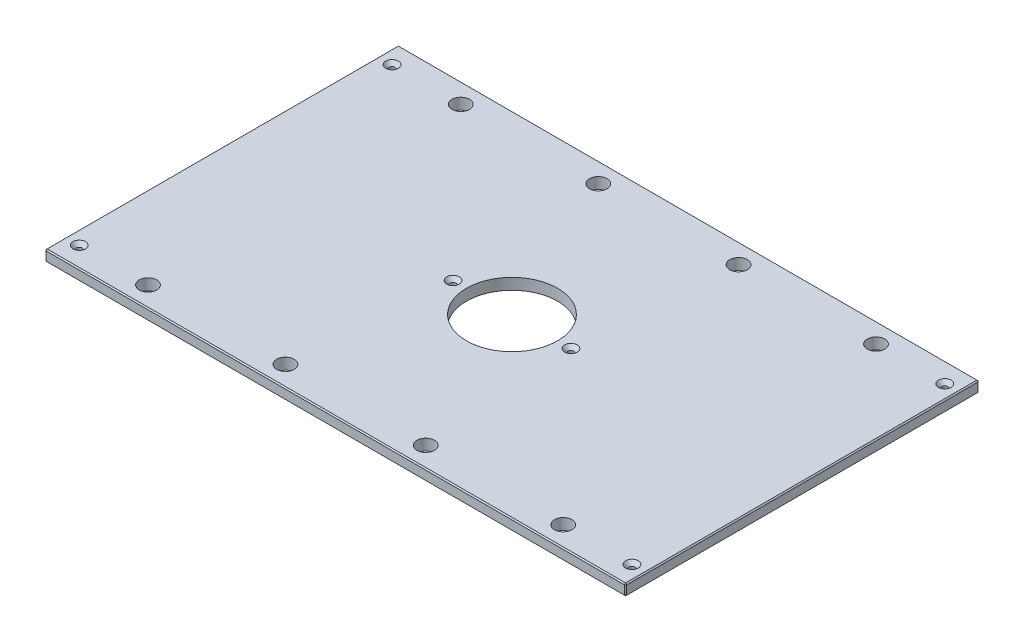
from build123d import *

# Parameters (mm, degrees)
SKETCH1_W                                        = 657.225
SKETCH1_H                                        = 400.05
BOSS_EXTRUDE1_DEPTH                              = 12.7
SKETCH13_R                                       = 51.562
CUT_EXTRUDE6_DEPTH                               = 385.91228323
F_25_32_0_78125_DIAMETER_HOLE1_D                 = 19.84375
CHAMFER2_SIZE                                    = 1.27
CSK_FOR_1_4_FLAT_HEAD_MACHINE_SCREW1_D           = 6.7564
CSK_FOR_1_4_FLAT_HEAD_MACHINE_SCREW1_CSINK_D     = 14.2748
CSK_FOR_1_4_FLAT_HEAD_MACHINE_SCREW1_CSINK_ANGLE = 82


with BuildPart() as part:
    # Sketch1 → Boss-Extrude1 (new body)
    with BuildSketch(Plane(origin=(0, 0, 0), x_dir=(1, 0, 0), z_dir=(0, 1, 0))):
        Rectangle(SKETCH1_W, SKETCH1_H)
    extrude(amount=BOSS_EXTRUDE1_DEPTH)

    # Sketch13 → Cut-Extrude6 (cut, through all)
    with BuildSketch(Plane(origin=(0, 12.7, 0), x_dir=(1, 0, 0), z_dir=(0, 1, 0))):
        with Locations(Location((0, 0, 0), (0, 0, 270))):
            Circle(SKETCH13_R)
    extrude(amount=-CUT_EXTRUDE6_DEPTH, mode=Mode.SUBTRACT)

    # 25_32 _0.78125_ Diameter Hole1 (through all)
    with Locations(Plane(origin=(0, 12.7, 0), x_dir=(1, 0, 0), z_dir=(0, 1, 0))):
        with Locations((234.95, 177.00498), (-234.95, 177.00498), (234.95, -177.00498), (-234.95, -177.00498), (-79.375, 177.00498), (79.375, 177.00498), (79.375, -177.00498), (-79.375, -177.00498)):
            Hole(F_25_32_0_78125_DIAMETER_HOLE1_D / 2)

    # Chamfer2
    chamfer2_edges = [part.edges().sort_by_distance(p)[0] for p in [
        (328.6125, 12.7, 0),
        (0, 12.7, -200.025),
        (-328.6125, 12.7, 0),
        (0, 0, -200.025),
        (328.6125, 0, 0),
        (0, 0, 200.025),
        (-328.6125, 0, 0),
        (0, 12.7, 200.025),
        (-328.6125, 6.35, -200.025),
        (328.6125, 6.35, -200.025),
        (328.6125, 6.35, 200.025),
        (-328.6125, 6.35, 200.025),
    ]]
    chamfer(chamfer2_edges, length=CHAMFER2_SIZE)

    # CSK for 1_4 Flat Head Machine Screw1 (through all)
    with Locations(Plane(origin=(0, 12.7, 0), x_dir=(1, 0, 0), z_dir=(0, 1, 0))):
        with Locations((312.7375, 177.00498), (312.7375, -177.00498), (-312.7375, -177.00498), (-66.675, 0), (66.675, 0), (-312.7375, 177.00498), (-234.95, 177.00498), (-234.95, -177.00498)):
            CounterSinkHole(CSK_FOR_1_4_FLAT_HEAD_MACHINE_SCREW1_D / 2, CSK_FOR_1_4_FLAT_HEAD_MACHINE_SCREW1_CSINK_D / 2, counter_sink_angle=CSK_FOR_1_4_FLAT_HEAD_MACHINE_SCREW1_CSINK_ANGLE)


solid = part.part
